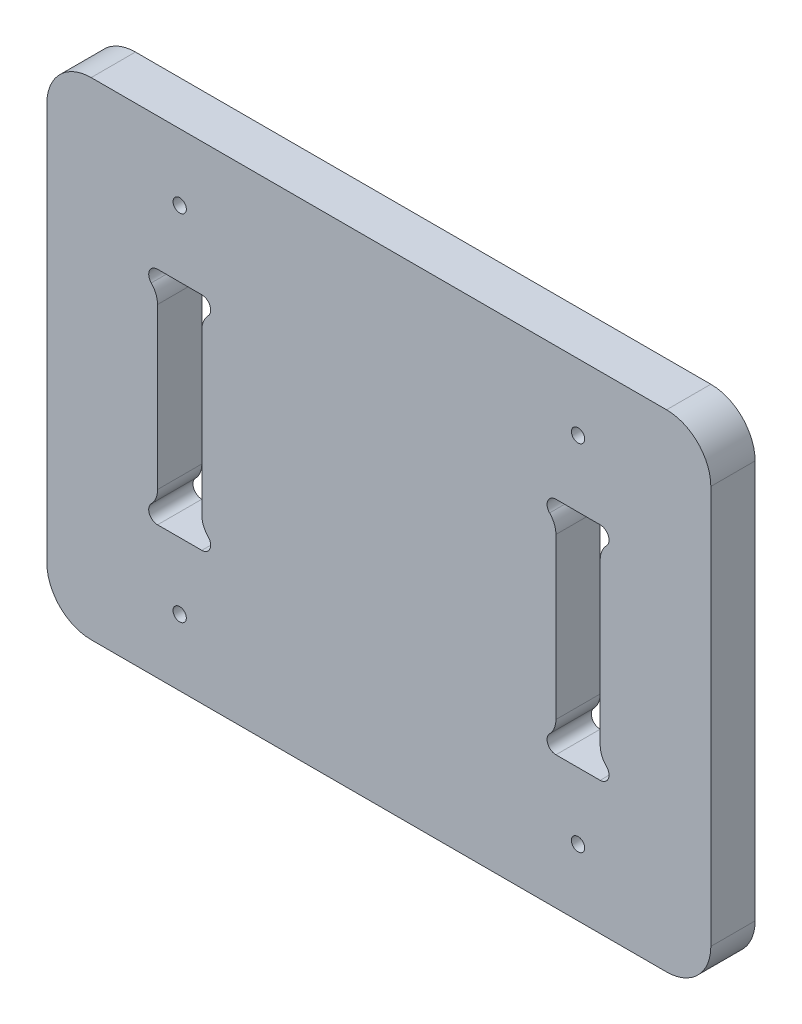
from build123d import *

# Parameters (mm, degrees)
BOSS_EXTRU_1_DEPTH      = 10
ESQUISSE1_R             = 1.5
ENL_V_MAT_EXTRU_1_DEPTH = 10
CHANFREIN1_SIZE         = 2.2


with BuildPart() as part:
    # Esquisse2 → Boss.-Extru.1 (new body)
    with BuildSketch(Plane.XY):
        with BuildLine():
            Line((10, 110), (140, 110))
            ThreePointArc((140, 110), (147.071067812, 107.071067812), (150, 100))
            Line((150, 100), (150, 10))
            ThreePointArc((150, 10), (147.071067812, 2.928932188), (140, 0))
            Line((140, 0), (10, 0))
            ThreePointArc((10, 0), (2.928932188, 2.928932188), (0, 10))
            Line((0, 10), (0, 100))
            ThreePointArc((0, 100), (2.928932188, 107.071067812), (10, 110))
        make_face()
    extrude(amount=BOSS_EXTRU_1_DEPTH)

    # Esquisse1 → Enl_v. mat.-Extru.1 (cut)
    with BuildSketch(Plane.XY):
        with Locations((30, 15)):
            Circle(ESQUISSE1_R)
        with Locations(Location((30, 95, 0), (0, 0, 180))):
            Circle(ESQUISSE1_R)
        with Locations((120, 15)):
            Circle(ESQUISSE1_R)
        with Locations(Location((120, 95, 0), (0, 0, 180))):
            Circle(ESQUISSE1_R)
        with BuildLine():
            Line((35, 30), (25, 30))
            ThreePointArc((25, 30), (23.156170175, 31.225215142), (23.571428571, 33.399708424))
            ThreePointArc((23.571428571, 33.399708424), (24.629100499, 35.009157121), (25, 36.898979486))
            Line((25, 36.898979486), (25, 73.101020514))
            ThreePointArc((25, 73.101020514), (24.629100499, 74.990842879), (23.571428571, 76.600291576))
            ThreePointArc((23.571428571, 76.600291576), (23.156170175, 78.774784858), (25, 80))
            Line((25, 80), (35, 80))
            ThreePointArc((35, 80), (36.843829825, 78.774784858), (36.428571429, 76.600291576))
            ThreePointArc((36.428571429, 76.600291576), (35.370899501, 74.990842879), (35, 73.101020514))
            Line((35, 73.101020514), (35, 36.898979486))
            ThreePointArc((35, 36.898979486), (35.370899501, 35.009157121), (36.428571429, 33.399708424))
            ThreePointArc((36.428571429, 33.399708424), (36.843829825, 31.225215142), (35, 30))
        make_face()
        with BuildLine():
            Line((125, 30), (115, 30))
            ThreePointArc((115, 30), (113.156170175, 31.225215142), (113.571428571, 33.399708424))
            ThreePointArc((113.571428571, 33.399708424), (114.629100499, 35.009157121), (115, 36.898979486))
            Line((115, 36.898979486), (115, 73.101020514))
            ThreePointArc((115, 73.101020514), (114.629100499, 74.990842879), (113.571428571, 76.600291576))
            ThreePointArc((113.571428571, 76.600291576), (113.156170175, 78.774784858), (115, 80))
            Line((115, 80), (125, 80))
            ThreePointArc((125, 80), (126.843829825, 78.774784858), (126.428571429, 76.600291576))
            ThreePointArc((126.428571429, 76.600291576), (125.370899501, 74.990842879), (125, 73.101020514))
            Line((125, 73.101020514), (125, 36.898979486))
            ThreePointArc((125, 36.898979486), (125.370899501, 35.009157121), (126.428571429, 33.399708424))
            ThreePointArc((126.428571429, 33.399708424), (126.843829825, 31.225215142), (125, 30))
        make_face()
    extrude(amount=ENL_V_MAT_EXTRU_1_DEPTH, mode=Mode.SUBTRACT)

    # Chanfrein1
    chanfrein1_edges = [part.edges().sort_by_distance(p)[0] for p in [
        (28.5, 15, 0),
        (121.5, 95, 0),
        (118.5, 15, 0),
        (31.5, 95, 0),
    ]]
    chamfer(chanfrein1_edges, length=CHANFREIN1_SIZE)


solid = part.part
